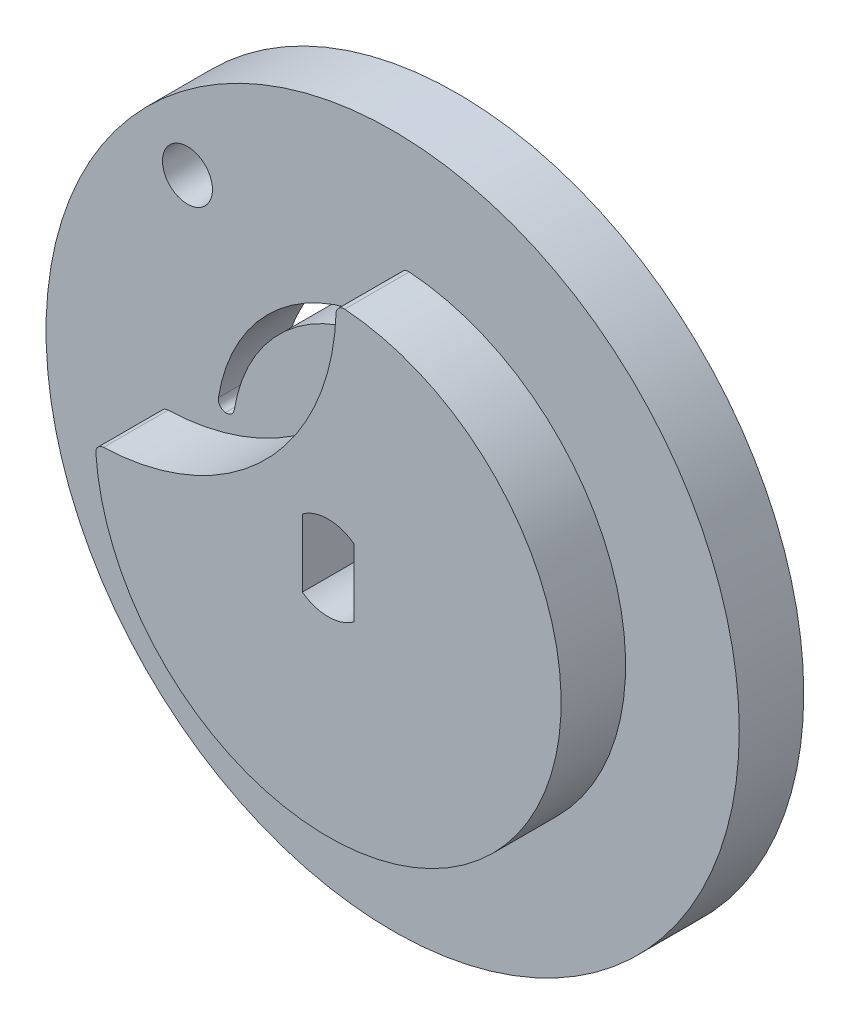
ISO-10303-21;
HEADER;
FILE_DESCRIPTION(('STEP AP214'),'2;1');
FILE_NAME('part.step','',(''),(''),'','','');
FILE_SCHEMA(('AUTOMOTIVE_DESIGN { 1 0 10303 214 1 1 1 1 }'));
ENDSEC;
DATA;
#1=APPLICATION_CONTEXT('core data for automotive mechanical design processes');
#2=APPLICATION_PROTOCOL_DEFINITION('international standard','automotive_design',2000,#1);
#3=PRODUCT_CONTEXT('',#1,'mechanical');
#4=PRODUCT('Part','Part','',(#3));
#5=PRODUCT_RELATED_PRODUCT_CATEGORY('part','',(#4));
#6=PRODUCT_DEFINITION_FORMATION('','',#4);
#7=PRODUCT_DEFINITION_CONTEXT('part definition',#1,'design');
#8=PRODUCT_DEFINITION('design','',#6,#7);
#9=PRODUCT_DEFINITION_SHAPE('','',#8);
#10=(LENGTH_UNIT() NAMED_UNIT(*) SI_UNIT(.MILLI.,.METRE.));
#11=(NAMED_UNIT(*) PLANE_ANGLE_UNIT() SI_UNIT($,.RADIAN.));
#12=(NAMED_UNIT(*) SI_UNIT($,.STERADIAN.) SOLID_ANGLE_UNIT());
#13=UNCERTAINTY_MEASURE_WITH_UNIT(LENGTH_MEASURE(1.E-05),#10,'distance_accuracy_value','');
#14=(GEOMETRIC_REPRESENTATION_CONTEXT(3) GLOBAL_UNCERTAINTY_ASSIGNED_CONTEXT((#13)) GLOBAL_UNIT_ASSIGNED_CONTEXT((#10,
#11,#12)) REPRESENTATION_CONTEXT('',''));
#15=CARTESIAN_POINT('',(0.,0.,0.));
#16=DIRECTION('',(0.,0.,1.));
#17=DIRECTION('',(1.,0.,0.));
#18=AXIS2_PLACEMENT_3D('',#15,#16,#17);
#19=CARTESIAN_POINT('',(0.,0.,4.));
#20=DIRECTION('',(0.,0.,1.));
#21=DIRECTION('',(1.,0.,0.));
#22=AXIS2_PLACEMENT_3D('',#19,#20,#21);
#23=PLANE('',#22);
#24=CARTESIAN_POINT('',(-10.3172463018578,1.66040017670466,4.));
#25=DIRECTION('',(0.,0.,1.));
#26=DIRECTION('',(1.,0.,0.));
#27=AXIS2_PLACEMENT_3D('',#24,#25,#26);
#28=CIRCLE('',#27,0.5);
#29=CARTESIAN_POINT('',(-9.82359815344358,1.58095519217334,4.));
#30=VERTEX_POINT('',#29);
#31=CARTESIAN_POINT('',(-10.372980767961,1.16351621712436,4.));
#32=VERTEX_POINT('',#31);
#33=EDGE_CURVE('E306',#30,#32,#28,.F.);
#34=ORIENTED_EDGE('',*,*,#33,.T.);
#35=CARTESIAN_POINT('',(-10.3172463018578,1.66040017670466,4.));
#36=DIRECTION('',(0.,0.,1.));
#37=DIRECTION('',(1.,0.,0.));
#38=AXIS2_PLACEMENT_3D('',#35,#36,#37);
#39=CIRCLE('',#38,0.5);
#40=CARTESIAN_POINT('',(-10.8108944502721,1.73984516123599,4.));
#41=VERTEX_POINT('',#40);
#42=EDGE_CURVE('E310',#32,#41,#39,.F.);
#43=ORIENTED_EDGE('',*,*,#42,.T.);
#44=CARTESIAN_POINT('',(0.,0.,4.));
#45=DIRECTION('',(0.,0.,1.));
#46=DIRECTION('',(-1.,0.,0.));
#47=AXIS2_PLACEMENT_3D('',#44,#45,#46);
#48=CIRCLE('',#47,10.95);
#49=CARTESIAN_POINT('',(-1.73984516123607,10.8108944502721,4.));
#50=VERTEX_POINT('',#49);
#51=EDGE_CURVE('E231',#50,#41,#48,.T.);
#52=ORIENTED_EDGE('',*,*,#51,.F.);
#53=CARTESIAN_POINT('',(-1.66040017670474,10.3172463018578,4.));
#54=DIRECTION('',(0.,0.,1.));
#55=DIRECTION('',(1.,0.,0.));
#56=AXIS2_PLACEMENT_3D('',#53,#54,#55);
#57=CIRCLE('',#56,0.5);
#58=CARTESIAN_POINT('',(-1.16351621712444,10.372980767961,4.));
#59=VERTEX_POINT('',#58);
#60=EDGE_CURVE('E11',#50,#59,#57,.F.);
#61=ORIENTED_EDGE('',*,*,#60,.T.);
#62=CARTESIAN_POINT('',(-1.66040017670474,10.3172463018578,4.));
#63=DIRECTION('',(0.,0.,1.));
#64=DIRECTION('',(1.,0.,0.));
#65=AXIS2_PLACEMENT_3D('',#62,#63,#64);
#66=CIRCLE('',#65,0.5);
#67=CARTESIAN_POINT('',(-1.58095519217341,9.82359815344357,4.));
#68=VERTEX_POINT('',#67);
#69=EDGE_CURVE('E313',#59,#68,#66,.F.);
#70=ORIENTED_EDGE('',*,*,#69,.T.);
#71=CARTESIAN_POINT('',(0.,0.,4.));
#72=DIRECTION('',(0.,0.,-1.));
#73=DIRECTION('',(-1.,0.,0.));
#74=AXIS2_PLACEMENT_3D('',#71,#72,#73);
#75=CIRCLE('',#74,9.95);
#76=EDGE_CURVE('E234',#30,#68,#75,.T.);
#77=ORIENTED_EDGE('',*,*,#76,.F.);
#78=EDGE_LOOP('',(#34,#43,#52,#61,#70,#77));
#79=FACE_BOUND('',#78,.T.);
#80=CARTESIAN_POINT('',(-12.7279220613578,12.7279220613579,4.));
#81=DIRECTION('',(0.,0.,1.));
#82=DIRECTION('',(1.,0.,0.));
#83=AXIS2_PLACEMENT_3D('',#80,#81,#82);
#84=CIRCLE('',#83,1.55);
#85=CARTESIAN_POINT('',(-11.1779220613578,12.7279220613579,4.));
#86=VERTEX_POINT('',#85);
#87=EDGE_CURVE('E242',#86,#86,#84,.T.);
#88=ORIENTED_EDGE('',*,*,#87,.F.);
#89=EDGE_LOOP('',(#88));
#90=FACE_BOUND('',#89,.T.);
#91=CARTESIAN_POINT('',(0.,0.,4.));
#92=DIRECTION('',(0.,0.,1.));
#93=DIRECTION('',(1.,0.,0.));
#94=AXIS2_PLACEMENT_3D('',#91,#92,#93);
#95=CIRCLE('',#94,21.5);
#96=CARTESIAN_POINT('',(21.5,0.,4.));
#97=VERTEX_POINT('',#96);
#98=EDGE_CURVE('E271',#97,#97,#95,.T.);
#99=ORIENTED_EDGE('',*,*,#98,.T.);
#100=EDGE_LOOP('',(#99));
#101=FACE_BOUND('',#100,.T.);
#102=CARTESIAN_POINT('',(0.,0.,4.));
#103=DIRECTION('',(0.,0.,1.));
#104=DIRECTION('',(1.,0.,0.));
#105=AXIS2_PLACEMENT_3D('',#102,#103,#104);
#106=CIRCLE('',#105,14.45);
#107=CARTESIAN_POINT('',(-14.4135176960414,-1.02616159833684,4.));
#108=VERTEX_POINT('',#107);
#109=CARTESIAN_POINT('',(1.02616159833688,14.4135176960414,4.));
#110=VERTEX_POINT('',#109);
#111=EDGE_CURVE('E223',#108,#110,#106,.T.);
#112=ORIENTED_EDGE('',*,*,#111,.F.);
#113=CARTESIAN_POINT('',(-13.9147800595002,-0.990654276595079,4.));
#114=DIRECTION('',(0.,0.,1.));
#115=DIRECTION('',(1.,0.,0.));
#116=AXIS2_PLACEMENT_3D('',#113,#114,#115);
#117=CIRCLE('',#116,0.5);
#118=CARTESIAN_POINT('',(-13.9321011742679,-0.490954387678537,4.));
#119=VERTEX_POINT('',#118);
#120=EDGE_CURVE('E300',#108,#119,#117,.F.);
#121=ORIENTED_EDGE('',*,*,#120,.T.);
#122=CARTESIAN_POINT('',(-14.45,14.45,4.));
#123=DIRECTION('',(0.,0.,-1.));
#124=DIRECTION('',(1.,0.,0.));
#125=AXIS2_PLACEMENT_3D('',#122,#123,#124);
#126=CIRCLE('',#125,14.9499276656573);
#127=CARTESIAN_POINT('',(0.490954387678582,13.9321011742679,4.));
#128=VERTEX_POINT('',#127);
#129=EDGE_CURVE('E218',#128,#119,#126,.T.);
#130=ORIENTED_EDGE('',*,*,#129,.F.);
#131=CARTESIAN_POINT('',(0.990654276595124,13.9147800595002,4.));
#132=DIRECTION('',(0.,0.,1.));
#133=DIRECTION('',(1.,0.,0.));
#134=AXIS2_PLACEMENT_3D('',#131,#132,#133);
#135=CIRCLE('',#134,0.5);
#136=EDGE_CURVE('E302',#128,#110,#135,.F.);
#137=ORIENTED_EDGE('',*,*,#136,.T.);
#138=EDGE_LOOP('',(#112,#121,#130,#137));
#139=FACE_BOUND('',#138,.T.);
#140=ADVANCED_FACE('F45',(#79,#90,#101,#139),#23,.T.);
#141=CARTESIAN_POINT('',(0.,0.,0.));
#142=DIRECTION('',(0.,0.,1.));
#143=DIRECTION('',(1.,0.,0.));
#144=AXIS2_PLACEMENT_3D('',#141,#142,#143);
#145=PLANE('',#144);
#146=CARTESIAN_POINT('',(-12.7279220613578,12.7279220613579,0.));
#147=DIRECTION('',(0.,0.,1.));
#148=DIRECTION('',(1.,0.,0.));
#149=AXIS2_PLACEMENT_3D('',#146,#147,#148);
#150=CIRCLE('',#149,1.55);
#151=CARTESIAN_POINT('',(-11.1779220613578,12.7279220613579,0.));
#152=VERTEX_POINT('',#151);
#153=EDGE_CURVE('E238',#152,#152,#150,.T.);
#154=ORIENTED_EDGE('',*,*,#153,.T.);
#155=EDGE_LOOP('',(#154));
#156=FACE_BOUND('',#155,.T.);
#157=DIRECTION('',(0.,1.,0.));
#158=VECTOR('',#157,1.);
#159=CARTESIAN_POINT('',(1.6,-2.1,0.));
#160=LINE('',#159,#158);
#161=CARTESIAN_POINT('',(1.6,-2.1,0.));
#162=VERTEX_POINT('',#161);
#163=CARTESIAN_POINT('',(1.6,-2.08119661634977,0.));
#164=VERTEX_POINT('',#163);
#165=EDGE_CURVE('E257',#162,#164,#160,.T.);
#166=ORIENTED_EDGE('',*,*,#165,.T.);
#167=CARTESIAN_POINT('',(0.,0.,0.));
#168=DIRECTION('',(0.,0.,-1.));
#169=DIRECTION('',(-1.,0.,0.));
#170=AXIS2_PLACEMENT_3D('',#167,#168,#169);
#171=CIRCLE('',#170,2.62514368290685);
#172=CARTESIAN_POINT('',(1.6,2.08119661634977,0.));
#173=VERTEX_POINT('',#172);
#174=EDGE_CURVE('E178',#173,#164,#171,.T.);
#175=ORIENTED_EDGE('',*,*,#174,.F.);
#176=CARTESIAN_POINT('',(1.6,2.1,0.));
#177=VERTEX_POINT('',#176);
#178=EDGE_CURVE('E189',#173,#177,#160,.T.);
#179=ORIENTED_EDGE('',*,*,#178,.T.);
#180=CARTESIAN_POINT('',(0.,-0.0748563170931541,0.));
#181=DIRECTION('',(0.,0.,1.));
#182=DIRECTION('',(-1.,0.,0.));
#183=AXIS2_PLACEMENT_3D('',#180,#181,#182);
#184=CIRCLE('',#183,2.7);
#185=CARTESIAN_POINT('',(-1.6,2.1,0.));
#186=VERTEX_POINT('',#185);
#187=EDGE_CURVE('E245',#177,#186,#184,.T.);
#188=ORIENTED_EDGE('',*,*,#187,.T.);
#189=DIRECTION('',(0.,-1.,0.));
#190=VECTOR('',#189,1.);
#191=CARTESIAN_POINT('',(-1.6,-2.1,0.));
#192=LINE('',#191,#190);
#193=CARTESIAN_POINT('',(-1.6,2.08119661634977,0.));
#194=VERTEX_POINT('',#193);
#195=EDGE_CURVE('E251',#186,#194,#192,.T.);
#196=ORIENTED_EDGE('',*,*,#195,.T.);
#197=CARTESIAN_POINT('',(0.,0.,0.));
#198=DIRECTION('',(0.,0.,-1.));
#199=DIRECTION('',(-1.,0.,0.));
#200=AXIS2_PLACEMENT_3D('',#197,#198,#199);
#201=CIRCLE('',#200,2.62514368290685);
#202=CARTESIAN_POINT('',(-1.6,-2.08119661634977,0.));
#203=VERTEX_POINT('',#202);
#204=EDGE_CURVE('E198',#203,#194,#201,.T.);
#205=ORIENTED_EDGE('',*,*,#204,.F.);
#206=CARTESIAN_POINT('',(-1.6,-2.1,0.));
#207=VERTEX_POINT('',#206);
#208=EDGE_CURVE('E250',#203,#207,#192,.T.);
#209=ORIENTED_EDGE('',*,*,#208,.T.);
#210=CARTESIAN_POINT('',(0.,0.0748563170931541,0.));
#211=DIRECTION('',(0.,0.,1.));
#212=DIRECTION('',(1.,0.,0.));
#213=AXIS2_PLACEMENT_3D('',#210,#211,#212);
#214=CIRCLE('',#213,2.7);
#215=EDGE_CURVE('E254',#207,#162,#214,.T.);
#216=ORIENTED_EDGE('',*,*,#215,.T.);
#217=EDGE_LOOP('',(#166,#175,#179,#188,#196,#205,#209,#216));
#218=FACE_BOUND('',#217,.T.);
#219=CARTESIAN_POINT('',(0.,0.,0.));
#220=DIRECTION('',(0.,0.,1.));
#221=DIRECTION('',(1.,0.,0.));
#222=AXIS2_PLACEMENT_3D('',#219,#220,#221);
#223=CIRCLE('',#222,21.5);
#224=CARTESIAN_POINT('',(21.5,0.,0.));
#225=VERTEX_POINT('',#224);
#226=EDGE_CURVE('E270',#225,#225,#223,.T.);
#227=ORIENTED_EDGE('',*,*,#226,.F.);
#228=EDGE_LOOP('',(#227));
#229=FACE_BOUND('',#228,.T.);
#230=CARTESIAN_POINT('',(-1.66040017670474,10.3172463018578,0.));
#231=DIRECTION('',(0.,0.,1.));
#232=DIRECTION('',(1.,0.,0.));
#233=AXIS2_PLACEMENT_3D('',#230,#231,#232);
#234=CIRCLE('',#233,0.5);
#235=CARTESIAN_POINT('',(-1.58095519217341,9.82359815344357,0.));
#236=VERTEX_POINT('',#235);
#237=CARTESIAN_POINT('',(-1.16351621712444,10.372980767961,0.));
#238=VERTEX_POINT('',#237);
#239=EDGE_CURVE('E68',#236,#238,#234,.T.);
#240=ORIENTED_EDGE('',*,*,#239,.T.);
#241=CARTESIAN_POINT('',(-1.66040017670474,10.3172463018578,0.));
#242=DIRECTION('',(0.,0.,1.));
#243=DIRECTION('',(1.,0.,0.));
#244=AXIS2_PLACEMENT_3D('',#241,#242,#243);
#245=CIRCLE('',#244,0.5);
#246=CARTESIAN_POINT('',(-1.73984516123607,10.8108944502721,0.));
#247=VERTEX_POINT('',#246);
#248=EDGE_CURVE('E54',#238,#247,#245,.T.);
#249=ORIENTED_EDGE('',*,*,#248,.T.);
#250=CARTESIAN_POINT('',(0.,0.,0.));
#251=DIRECTION('',(0.,0.,1.));
#252=DIRECTION('',(-1.,0.,0.));
#253=AXIS2_PLACEMENT_3D('',#250,#251,#252);
#254=CIRCLE('',#253,10.95);
#255=CARTESIAN_POINT('',(-10.8108944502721,1.73984516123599,0.));
#256=VERTEX_POINT('',#255);
#257=EDGE_CURVE('E226',#247,#256,#254,.T.);
#258=ORIENTED_EDGE('',*,*,#257,.T.);
#259=CARTESIAN_POINT('',(-10.3172463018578,1.66040017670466,0.));
#260=DIRECTION('',(0.,0.,1.));
#261=DIRECTION('',(1.,0.,0.));
#262=AXIS2_PLACEMENT_3D('',#259,#260,#261);
#263=CIRCLE('',#262,0.5);
#264=CARTESIAN_POINT('',(-10.372980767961,1.16351621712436,0.));
#265=VERTEX_POINT('',#264);
#266=EDGE_CURVE('E308',#256,#265,#263,.T.);
#267=ORIENTED_EDGE('',*,*,#266,.T.);
#268=CARTESIAN_POINT('',(-10.3172463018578,1.66040017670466,0.));
#269=DIRECTION('',(0.,0.,1.));
#270=DIRECTION('',(1.,0.,0.));
#271=AXIS2_PLACEMENT_3D('',#268,#269,#270);
#272=CIRCLE('',#271,0.5);
#273=CARTESIAN_POINT('',(-9.82359815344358,1.58095519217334,0.));
#274=VERTEX_POINT('',#273);
#275=EDGE_CURVE('E304',#265,#274,#272,.T.);
#276=ORIENTED_EDGE('',*,*,#275,.T.);
#277=CARTESIAN_POINT('',(0.,0.,0.));
#278=DIRECTION('',(0.,0.,-1.));
#279=DIRECTION('',(-1.,0.,0.));
#280=AXIS2_PLACEMENT_3D('',#277,#278,#279);
#281=CIRCLE('',#280,9.95);
#282=EDGE_CURVE('E235',#274,#236,#281,.T.);
#283=ORIENTED_EDGE('',*,*,#282,.T.);
#284=EDGE_LOOP('',(#240,#249,#258,#267,#276,#283));
#285=FACE_BOUND('',#284,.T.);
#286=ADVANCED_FACE('F327',(#156,#218,#229,#285),#145,.F.);
#287=CARTESIAN_POINT('',(0.,0.,4.));
#288=DIRECTION('',(0.,0.,-1.));
#289=DIRECTION('',(-1.,0.,0.));
#290=AXIS2_PLACEMENT_3D('',#287,#288,#289);
#291=CYLINDRICAL_SURFACE('',#290,21.5);
#292=ORIENTED_EDGE('',*,*,#98,.F.);
#293=EDGE_LOOP('',(#292));
#294=FACE_BOUND('',#293,.T.);
#295=ORIENTED_EDGE('',*,*,#226,.T.);
#296=EDGE_LOOP('',(#295));
#297=FACE_BOUND('',#296,.T.);
#298=ADVANCED_FACE('F382',(#294,#297),#291,.T.);
#299=CARTESIAN_POINT('',(0.,-0.0748563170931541,4.));
#300=DIRECTION('',(0.,0.,-1.));
#301=DIRECTION('',(-1.,0.,0.));
#302=AXIS2_PLACEMENT_3D('',#299,#300,#301);
#303=CYLINDRICAL_SURFACE('',#302,2.7);
#304=ORIENTED_EDGE('',*,*,#187,.F.);
#305=DIRECTION('',(0.,0.,-1.));
#306=VECTOR('',#305,1.);
#307=CARTESIAN_POINT('',(1.6,2.1,4.));
#308=LINE('',#307,#306);
#309=CARTESIAN_POINT('',(1.6,2.1,8.));
#310=VERTEX_POINT('',#309);
#311=EDGE_CURVE('E260',#310,#177,#308,.T.);
#312=ORIENTED_EDGE('',*,*,#311,.F.);
#313=CARTESIAN_POINT('',(0.,-0.0748563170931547,8.));
#314=DIRECTION('',(0.,0.,1.));
#315=DIRECTION('',(-1.,0.,0.));
#316=AXIS2_PLACEMENT_3D('',#313,#314,#315);
#317=CIRCLE('',#316,2.7);
#318=CARTESIAN_POINT('',(-1.6,2.1,8.));
#319=VERTEX_POINT('',#318);
#320=EDGE_CURVE('E191',#310,#319,#317,.T.);
#321=ORIENTED_EDGE('',*,*,#320,.T.);
#322=DIRECTION('',(0.,0.,-1.));
#323=VECTOR('',#322,1.);
#324=CARTESIAN_POINT('',(-1.6,2.1,4.));
#325=LINE('',#324,#323);
#326=EDGE_CURVE('E267',#319,#186,#325,.T.);
#327=ORIENTED_EDGE('',*,*,#326,.T.);
#328=EDGE_LOOP('',(#304,#312,#321,#327));
#329=FACE_BOUND('',#328,.T.);
#330=ADVANCED_FACE('F505',(#329),#303,.F.);
#331=CARTESIAN_POINT('',(-1.6,-2.1,4.));
#332=DIRECTION('',(1.,0.,0.));
#333=DIRECTION('',(0.,0.,-1.));
#334=AXIS2_PLACEMENT_3D('',#331,#332,#333);
#335=PLANE('',#334);
#336=DIRECTION('',(0.,0.,-1.));
#337=VECTOR('',#336,1.);
#338=CARTESIAN_POINT('',(-1.6,-2.08119661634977,1.2));
#339=LINE('',#338,#337);
#340=CARTESIAN_POINT('',(-1.6,-2.08119661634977,1.2));
#341=VERTEX_POINT('',#340);
#342=EDGE_CURVE('E200',#341,#203,#339,.T.);
#343=ORIENTED_EDGE('',*,*,#342,.F.);
#344=DIRECTION('',(0.,-1.,0.));
#345=VECTOR('',#344,1.);
#346=CARTESIAN_POINT('',(-1.6,0.,1.2));
#347=LINE('',#346,#345);
#348=CARTESIAN_POINT('',(-1.6,2.08119661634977,1.2));
#349=VERTEX_POINT('',#348);
#350=EDGE_CURVE('E195',#349,#341,#347,.T.);
#351=ORIENTED_EDGE('',*,*,#350,.F.);
#352=DIRECTION('',(0.,0.,-1.));
#353=VECTOR('',#352,1.);
#354=CARTESIAN_POINT('',(-1.6,2.08119661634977,1.2));
#355=LINE('',#354,#353);
#356=EDGE_CURVE('E203',#349,#194,#355,.T.);
#357=ORIENTED_EDGE('',*,*,#356,.T.);
#358=ORIENTED_EDGE('',*,*,#195,.F.);
#359=ORIENTED_EDGE('',*,*,#326,.F.);
#360=DIRECTION('',(0.,-1.,0.));
#361=VECTOR('',#360,1.);
#362=CARTESIAN_POINT('',(-1.6,-2.1,8.));
#363=LINE('',#362,#361);
#364=CARTESIAN_POINT('',(-1.6,-2.1,8.));
#365=VERTEX_POINT('',#364);
#366=EDGE_CURVE('E209',#319,#365,#363,.T.);
#367=ORIENTED_EDGE('',*,*,#366,.T.);
#368=DIRECTION('',(0.,0.,-1.));
#369=VECTOR('',#368,1.);
#370=CARTESIAN_POINT('',(-1.6,-2.1,4.));
#371=LINE('',#370,#369);
#372=EDGE_CURVE('E264',#365,#207,#371,.T.);
#373=ORIENTED_EDGE('',*,*,#372,.T.);
#374=ORIENTED_EDGE('',*,*,#208,.F.);
#375=EDGE_LOOP('',(#343,#351,#357,#358,#359,#367,#373,#374));
#376=FACE_BOUND('',#375,.T.);
#377=ADVANCED_FACE('F493',(#376),#335,.T.);
#378=CARTESIAN_POINT('',(0.,0.0748563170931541,4.));
#379=DIRECTION('',(0.,0.,-1.));
#380=DIRECTION('',(-1.,0.,0.));
#381=AXIS2_PLACEMENT_3D('',#378,#379,#380);
#382=CYLINDRICAL_SURFACE('',#381,2.7);
#383=ORIENTED_EDGE('',*,*,#215,.F.);
#384=ORIENTED_EDGE('',*,*,#372,.F.);
#385=CARTESIAN_POINT('',(0.,0.0748563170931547,8.));
#386=DIRECTION('',(0.,0.,1.));
#387=DIRECTION('',(1.,0.,0.));
#388=AXIS2_PLACEMENT_3D('',#385,#386,#387);
#389=CIRCLE('',#388,2.7);
#390=CARTESIAN_POINT('',(1.6,-2.1,8.));
#391=VERTEX_POINT('',#390);
#392=EDGE_CURVE('E212',#365,#391,#389,.T.);
#393=ORIENTED_EDGE('',*,*,#392,.T.);
#394=DIRECTION('',(0.,0.,-1.));
#395=VECTOR('',#394,1.);
#396=CARTESIAN_POINT('',(1.6,-2.1,4.));
#397=LINE('',#396,#395);
#398=EDGE_CURVE('E262',#391,#162,#397,.T.);
#399=ORIENTED_EDGE('',*,*,#398,.T.);
#400=EDGE_LOOP('',(#383,#384,#393,#399));
#401=FACE_BOUND('',#400,.T.);
#402=ADVANCED_FACE('F480',(#401),#382,.F.);
#403=CARTESIAN_POINT('',(1.6,-2.1,4.));
#404=DIRECTION('',(-1.,0.,0.));
#405=DIRECTION('',(0.,0.,1.));
#406=AXIS2_PLACEMENT_3D('',#403,#404,#405);
#407=PLANE('',#406);
#408=DIRECTION('',(0.,0.,-1.));
#409=VECTOR('',#408,1.);
#410=CARTESIAN_POINT('',(1.6,2.08119661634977,1.2));
#411=LINE('',#410,#409);
#412=CARTESIAN_POINT('',(1.6,2.08119661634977,1.2));
#413=VERTEX_POINT('',#412);
#414=EDGE_CURVE('E182',#413,#173,#411,.T.);
#415=ORIENTED_EDGE('',*,*,#414,.F.);
#416=DIRECTION('',(0.,1.,0.));
#417=VECTOR('',#416,1.);
#418=CARTESIAN_POINT('',(1.6,0.,1.2));
#419=LINE('',#418,#417);
#420=CARTESIAN_POINT('',(1.6,-2.08119661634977,1.2));
#421=VERTEX_POINT('',#420);
#422=EDGE_CURVE('E170',#421,#413,#419,.T.);
#423=ORIENTED_EDGE('',*,*,#422,.F.);
#424=DIRECTION('',(0.,0.,-1.));
#425=VECTOR('',#424,1.);
#426=CARTESIAN_POINT('',(1.6,-2.08119661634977,1.2));
#427=LINE('',#426,#425);
#428=EDGE_CURVE('E184',#421,#164,#427,.T.);
#429=ORIENTED_EDGE('',*,*,#428,.T.);
#430=ORIENTED_EDGE('',*,*,#165,.F.);
#431=ORIENTED_EDGE('',*,*,#398,.F.);
#432=DIRECTION('',(0.,1.,0.));
#433=VECTOR('',#432,1.);
#434=CARTESIAN_POINT('',(1.6,-2.1,8.));
#435=LINE('',#434,#433);
#436=EDGE_CURVE('E215',#391,#310,#435,.T.);
#437=ORIENTED_EDGE('',*,*,#436,.T.);
#438=ORIENTED_EDGE('',*,*,#311,.T.);
#439=ORIENTED_EDGE('',*,*,#178,.F.);
#440=EDGE_LOOP('',(#415,#423,#429,#430,#431,#437,#438,#439));
#441=FACE_BOUND('',#440,.T.);
#442=ADVANCED_FACE('F187',(#441),#407,.T.);
#443=CARTESIAN_POINT('',(-12.7279220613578,12.7279220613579,4.));
#444=DIRECTION('',(0.,0.,-1.));
#445=DIRECTION('',(-1.,0.,0.));
#446=AXIS2_PLACEMENT_3D('',#443,#444,#445);
#447=CYLINDRICAL_SURFACE('',#446,1.55);
#448=ORIENTED_EDGE('',*,*,#87,.T.);
#449=EDGE_LOOP('',(#448));
#450=FACE_BOUND('',#449,.T.);
#451=ORIENTED_EDGE('',*,*,#153,.F.);
#452=EDGE_LOOP('',(#451));
#453=FACE_BOUND('',#452,.T.);
#454=ADVANCED_FACE('F479',(#450,#453),#447,.F.);
#455=CARTESIAN_POINT('',(0.,0.,4.));
#456=DIRECTION('',(0.,0.,-1.));
#457=DIRECTION('',(-1.,0.,0.));
#458=AXIS2_PLACEMENT_3D('',#455,#456,#457);
#459=CYLINDRICAL_SURFACE('',#458,10.95);
#460=ORIENTED_EDGE('',*,*,#51,.T.);
#461=DIRECTION('',(0.,0.,-1.));
#462=VECTOR('',#461,1.);
#463=CARTESIAN_POINT('',(-10.8108944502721,1.73984516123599,4.));
#464=LINE('',#463,#462);
#465=EDGE_CURVE('E298',#41,#256,#464,.T.);
#466=ORIENTED_EDGE('',*,*,#465,.T.);
#467=ORIENTED_EDGE('',*,*,#257,.F.);
#468=DIRECTION('',(0.,0.,-1.));
#469=VECTOR('',#468,1.);
#470=CARTESIAN_POINT('',(-1.73984516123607,10.8108944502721,4.));
#471=LINE('',#470,#469);
#472=EDGE_CURVE('E296',#247,#50,#471,.F.);
#473=ORIENTED_EDGE('',*,*,#472,.T.);
#474=EDGE_LOOP('',(#460,#466,#467,#473));
#475=FACE_BOUND('',#474,.T.);
#476=ADVANCED_FACE('F330',(#475),#459,.F.);
#477=CARTESIAN_POINT('',(0.,0.,4.));
#478=DIRECTION('',(0.,0.,-1.));
#479=DIRECTION('',(-1.,0.,0.));
#480=AXIS2_PLACEMENT_3D('',#477,#478,#479);
#481=CYLINDRICAL_SURFACE('',#480,9.95);
#482=ORIENTED_EDGE('',*,*,#282,.F.);
#483=DIRECTION('',(0.,0.,-1.));
#484=VECTOR('',#483,1.);
#485=CARTESIAN_POINT('',(-9.82359815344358,1.58095519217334,4.));
#486=LINE('',#485,#484);
#487=EDGE_CURVE('E293',#274,#30,#486,.F.);
#488=ORIENTED_EDGE('',*,*,#487,.T.);
#489=ORIENTED_EDGE('',*,*,#76,.T.);
#490=DIRECTION('',(0.,0.,-1.));
#491=VECTOR('',#490,1.);
#492=CARTESIAN_POINT('',(-1.58095519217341,9.82359815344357,4.));
#493=LINE('',#492,#491);
#494=EDGE_CURVE('E290',#68,#236,#493,.T.);
#495=ORIENTED_EDGE('',*,*,#494,.T.);
#496=EDGE_LOOP('',(#482,#488,#489,#495));
#497=FACE_BOUND('',#496,.T.);
#498=ADVANCED_FACE('F338',(#497),#481,.T.);
#499=CARTESIAN_POINT('',(-7.225,7.22500000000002,8.));
#500=DIRECTION('',(0.,0.,1.));
#501=DIRECTION('',(1.,0.,0.));
#502=AXIS2_PLACEMENT_3D('',#499,#500,#501);
#503=PLANE('',#502);
#504=CARTESIAN_POINT('',(-14.45,14.45,8.));
#505=DIRECTION('',(0.,0.,-1.));
#506=DIRECTION('',(1.,0.,0.));
#507=AXIS2_PLACEMENT_3D('',#504,#505,#506);
#508=CIRCLE('',#507,14.9499276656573);
#509=CARTESIAN_POINT('',(0.490954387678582,13.9321011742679,8.));
#510=VERTEX_POINT('',#509);
#511=CARTESIAN_POINT('',(-13.9321011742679,-0.490954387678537,8.));
#512=VERTEX_POINT('',#511);
#513=EDGE_CURVE('E219',#510,#512,#508,.T.);
#514=ORIENTED_EDGE('',*,*,#513,.T.);
#515=CARTESIAN_POINT('',(-13.9147800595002,-0.990654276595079,8.));
#516=DIRECTION('',(0.,0.,1.));
#517=DIRECTION('',(1.,0.,0.));
#518=AXIS2_PLACEMENT_3D('',#515,#516,#517);
#519=CIRCLE('',#518,0.5);
#520=CARTESIAN_POINT('',(-14.4135176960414,-1.02616159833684,8.));
#521=VERTEX_POINT('',#520);
#522=EDGE_CURVE('E288',#512,#521,#519,.T.);
#523=ORIENTED_EDGE('',*,*,#522,.T.);
#524=CARTESIAN_POINT('',(0.,0.,8.));
#525=DIRECTION('',(0.,0.,1.));
#526=DIRECTION('',(1.,0.,0.));
#527=AXIS2_PLACEMENT_3D('',#524,#525,#526);
#528=CIRCLE('',#527,14.45);
#529=CARTESIAN_POINT('',(1.02616159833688,14.4135176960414,8.));
#530=VERTEX_POINT('',#529);
#531=EDGE_CURVE('E222',#521,#530,#528,.T.);
#532=ORIENTED_EDGE('',*,*,#531,.T.);
#533=CARTESIAN_POINT('',(0.990654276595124,13.9147800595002,8.));
#534=DIRECTION('',(0.,0.,1.));
#535=DIRECTION('',(1.,0.,0.));
#536=AXIS2_PLACEMENT_3D('',#533,#534,#535);
#537=CIRCLE('',#536,0.5);
#538=EDGE_CURVE('E286',#530,#510,#537,.T.);
#539=ORIENTED_EDGE('',*,*,#538,.T.);
#540=EDGE_LOOP('',(#514,#523,#532,#539));
#541=FACE_BOUND('',#540,.T.);
#542=ORIENTED_EDGE('',*,*,#366,.F.);
#543=ORIENTED_EDGE('',*,*,#320,.F.);
#544=ORIENTED_EDGE('',*,*,#436,.F.);
#545=ORIENTED_EDGE('',*,*,#392,.F.);
#546=EDGE_LOOP('',(#542,#543,#544,#545));
#547=FACE_BOUND('',#546,.T.);
#548=ADVANCED_FACE('F361',(#541,#547),#503,.T.);
#549=CARTESIAN_POINT('',(-14.45,14.45,8.));
#550=DIRECTION('',(0.,0.,-1.));
#551=DIRECTION('',(-1.,0.,0.));
#552=AXIS2_PLACEMENT_3D('',#549,#550,#551);
#553=CYLINDRICAL_SURFACE('',#552,14.9499276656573);
#554=ORIENTED_EDGE('',*,*,#129,.T.);
#555=DIRECTION('',(0.,0.,-1.));
#556=VECTOR('',#555,1.);
#557=CARTESIAN_POINT('',(-13.9321011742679,-0.490954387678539,8.));
#558=LINE('',#557,#556);
#559=EDGE_CURVE('E284',#119,#512,#558,.F.);
#560=ORIENTED_EDGE('',*,*,#559,.T.);
#561=ORIENTED_EDGE('',*,*,#513,.F.);
#562=DIRECTION('',(0.,0.,-1.));
#563=VECTOR('',#562,1.);
#564=CARTESIAN_POINT('',(0.490954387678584,13.9321011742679,8.));
#565=LINE('',#564,#563);
#566=EDGE_CURVE('E281',#510,#128,#565,.T.);
#567=ORIENTED_EDGE('',*,*,#566,.T.);
#568=EDGE_LOOP('',(#554,#560,#561,#567));
#569=FACE_BOUND('',#568,.T.);
#570=ADVANCED_FACE('F365',(#569),#553,.F.);
#571=CARTESIAN_POINT('',(0.,0.,8.));
#572=DIRECTION('',(0.,0.,-1.));
#573=DIRECTION('',(-1.,0.,0.));
#574=AXIS2_PLACEMENT_3D('',#571,#572,#573);
#575=CYLINDRICAL_SURFACE('',#574,14.45);
#576=ORIENTED_EDGE('',*,*,#531,.F.);
#577=DIRECTION('',(0.,0.,-1.));
#578=VECTOR('',#577,1.);
#579=CARTESIAN_POINT('',(-14.4135176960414,-1.02616159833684,8.));
#580=LINE('',#579,#578);
#581=EDGE_CURVE('E278',#521,#108,#580,.T.);
#582=ORIENTED_EDGE('',*,*,#581,.T.);
#583=ORIENTED_EDGE('',*,*,#111,.T.);
#584=DIRECTION('',(0.,0.,-1.));
#585=VECTOR('',#584,1.);
#586=CARTESIAN_POINT('',(1.02616159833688,14.4135176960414,8.));
#587=LINE('',#586,#585);
#588=EDGE_CURVE('E274',#110,#530,#587,.F.);
#589=ORIENTED_EDGE('',*,*,#588,.T.);
#590=EDGE_LOOP('',(#576,#582,#583,#589));
#591=FACE_BOUND('',#590,.T.);
#592=ADVANCED_FACE('F353',(#591),#575,.T.);
#593=CARTESIAN_POINT('',(0.,0.,1.2));
#594=DIRECTION('',(0.,0.,-1.));
#595=DIRECTION('',(-1.,0.,0.));
#596=AXIS2_PLACEMENT_3D('',#593,#594,#595);
#597=CYLINDRICAL_SURFACE('',#596,2.62514368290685);
#598=ORIENTED_EDGE('',*,*,#174,.T.);
#599=ORIENTED_EDGE('',*,*,#428,.F.);
#600=CARTESIAN_POINT('',(0.,0.,1.2));
#601=DIRECTION('',(0.,0.,-1.));
#602=DIRECTION('',(-1.,0.,0.));
#603=AXIS2_PLACEMENT_3D('',#600,#601,#602);
#604=CIRCLE('',#603,2.62514368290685);
#605=EDGE_CURVE('E173',#413,#421,#604,.T.);
#606=ORIENTED_EDGE('',*,*,#605,.F.);
#607=ORIENTED_EDGE('',*,*,#414,.T.);
#608=EDGE_LOOP('',(#598,#599,#606,#607));
#609=FACE_BOUND('',#608,.T.);
#610=ADVANCED_FACE('F181',(#609),#597,.F.);
#611=CARTESIAN_POINT('',(0.,0.,1.2));
#612=DIRECTION('',(0.,0.,-1.));
#613=DIRECTION('',(-1.,0.,0.));
#614=AXIS2_PLACEMENT_3D('',#611,#612,#613);
#615=PLANE('',#614);
#616=ORIENTED_EDGE('',*,*,#422,.T.);
#617=ORIENTED_EDGE('',*,*,#605,.T.);
#618=EDGE_LOOP('',(#616,#617));
#619=FACE_BOUND('',#618,.T.);
#620=ADVANCED_FACE('F172',(#619),#615,.T.);
#621=CARTESIAN_POINT('',(0.,0.,1.2));
#622=DIRECTION('',(0.,0.,-1.));
#623=DIRECTION('',(-1.,0.,0.));
#624=AXIS2_PLACEMENT_3D('',#621,#622,#623);
#625=CYLINDRICAL_SURFACE('',#624,2.62514368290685);
#626=ORIENTED_EDGE('',*,*,#204,.T.);
#627=ORIENTED_EDGE('',*,*,#356,.F.);
#628=CARTESIAN_POINT('',(0.,0.,1.2));
#629=DIRECTION('',(0.,0.,-1.));
#630=DIRECTION('',(-1.,0.,0.));
#631=AXIS2_PLACEMENT_3D('',#628,#629,#630);
#632=CIRCLE('',#631,2.62514368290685);
#633=EDGE_CURVE('E197',#341,#349,#632,.T.);
#634=ORIENTED_EDGE('',*,*,#633,.F.);
#635=ORIENTED_EDGE('',*,*,#342,.T.);
#636=EDGE_LOOP('',(#626,#627,#634,#635));
#637=FACE_BOUND('',#636,.T.);
#638=ADVANCED_FACE('F378',(#637),#625,.F.);
#639=CARTESIAN_POINT('',(0.,0.,1.2));
#640=DIRECTION('',(0.,0.,-1.));
#641=DIRECTION('',(-1.,0.,0.));
#642=AXIS2_PLACEMENT_3D('',#639,#640,#641);
#643=PLANE('',#642);
#644=ORIENTED_EDGE('',*,*,#350,.T.);
#645=ORIENTED_EDGE('',*,*,#633,.T.);
#646=EDGE_LOOP('',(#644,#645));
#647=FACE_BOUND('',#646,.T.);
#648=ADVANCED_FACE('F370',(#647),#643,.T.);
#649=CARTESIAN_POINT('',(-13.9147800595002,-0.990654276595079,8.));
#650=DIRECTION('',(0.,0.,1.));
#651=DIRECTION('',(1.,0.,0.));
#652=AXIS2_PLACEMENT_3D('',#649,#650,#651);
#653=CYLINDRICAL_SURFACE('',#652,0.5);
#654=ORIENTED_EDGE('',*,*,#522,.F.);
#655=ORIENTED_EDGE('',*,*,#559,.F.);
#656=ORIENTED_EDGE('',*,*,#120,.F.);
#657=ORIENTED_EDGE('',*,*,#581,.F.);
#658=EDGE_LOOP('',(#654,#655,#656,#657));
#659=FACE_BOUND('',#658,.T.);
#660=ADVANCED_FACE('F368',(#659),#653,.T.);
#661=CARTESIAN_POINT('',(0.990654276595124,13.9147800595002,8.));
#662=DIRECTION('',(0.,0.,1.));
#663=DIRECTION('',(1.,0.,0.));
#664=AXIS2_PLACEMENT_3D('',#661,#662,#663);
#665=CYLINDRICAL_SURFACE('',#664,0.5);
#666=ORIENTED_EDGE('',*,*,#538,.F.);
#667=ORIENTED_EDGE('',*,*,#588,.F.);
#668=ORIENTED_EDGE('',*,*,#136,.F.);
#669=ORIENTED_EDGE('',*,*,#566,.F.);
#670=EDGE_LOOP('',(#666,#667,#668,#669));
#671=FACE_BOUND('',#670,.T.);
#672=ADVANCED_FACE('F357',(#671),#665,.T.);
#673=CARTESIAN_POINT('',(-10.3172463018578,1.66040017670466,4.));
#674=DIRECTION('',(0.,0.,-1.));
#675=DIRECTION('',(-1.,0.,0.));
#676=AXIS2_PLACEMENT_3D('',#673,#674,#675);
#677=CYLINDRICAL_SURFACE('',#676,0.5);
#678=ORIENTED_EDGE('',*,*,#465,.F.);
#679=ORIENTED_EDGE('',*,*,#42,.F.);
#680=DIRECTION('',(0.,0.,1.));
#681=VECTOR('',#680,1.);
#682=CARTESIAN_POINT('',(-10.372980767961,1.16351621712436,4.));
#683=LINE('',#682,#681);
#684=EDGE_CURVE('E202',#265,#32,#683,.T.);
#685=ORIENTED_EDGE('',*,*,#684,.F.);
#686=ORIENTED_EDGE('',*,*,#266,.F.);
#687=EDGE_LOOP('',(#678,#679,#685,#686));
#688=FACE_BOUND('',#687,.T.);
#689=ADVANCED_FACE('F334',(#688),#677,.F.);
#690=CARTESIAN_POINT('',(-10.3172463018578,1.66040017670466,4.));
#691=DIRECTION('',(0.,0.,-1.));
#692=DIRECTION('',(-1.,0.,0.));
#693=AXIS2_PLACEMENT_3D('',#690,#691,#692);
#694=CYLINDRICAL_SURFACE('',#693,0.5);
#695=ORIENTED_EDGE('',*,*,#33,.F.);
#696=ORIENTED_EDGE('',*,*,#487,.F.);
#697=ORIENTED_EDGE('',*,*,#275,.F.);
#698=ORIENTED_EDGE('',*,*,#684,.T.);
#699=EDGE_LOOP('',(#695,#696,#697,#698));
#700=FACE_BOUND('',#699,.T.);
#701=ADVANCED_FACE('F340',(#700),#694,.F.);
#702=CARTESIAN_POINT('',(-1.66040017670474,10.3172463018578,4.));
#703=DIRECTION('',(0.,0.,-1.));
#704=DIRECTION('',(-1.,0.,0.));
#705=AXIS2_PLACEMENT_3D('',#702,#703,#704);
#706=CYLINDRICAL_SURFACE('',#705,0.5);
#707=DIRECTION('',(0.,0.,1.));
#708=VECTOR('',#707,1.);
#709=CARTESIAN_POINT('',(-1.16351621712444,10.372980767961,0.));
#710=LINE('',#709,#708);
#711=EDGE_CURVE('E49',#59,#238,#710,.F.);
#712=ORIENTED_EDGE('',*,*,#711,.F.);
#713=ORIENTED_EDGE('',*,*,#60,.F.);
#714=ORIENTED_EDGE('',*,*,#472,.F.);
#715=ORIENTED_EDGE('',*,*,#248,.F.);
#716=EDGE_LOOP('',(#712,#713,#714,#715));
#717=FACE_BOUND('',#716,.T.);
#718=ADVANCED_FACE('F47',(#717),#706,.F.);
#719=CARTESIAN_POINT('',(-1.66040017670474,10.3172463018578,4.));
#720=DIRECTION('',(0.,0.,-1.));
#721=DIRECTION('',(-1.,0.,0.));
#722=AXIS2_PLACEMENT_3D('',#719,#720,#721);
#723=CYLINDRICAL_SURFACE('',#722,0.5);
#724=ORIENTED_EDGE('',*,*,#69,.F.);
#725=ORIENTED_EDGE('',*,*,#711,.T.);
#726=ORIENTED_EDGE('',*,*,#239,.F.);
#727=ORIENTED_EDGE('',*,*,#494,.F.);
#728=EDGE_LOOP('',(#724,#725,#726,#727));
#729=FACE_BOUND('',#728,.T.);
#730=ADVANCED_FACE('F322',(#729),#723,.F.);
#731=CLOSED_SHELL('',(#140,#286,#298,#330,#377,#402,#442,#454,#476,#498,#548,#570,#592,#610,
#620,#638,#648,#660,#672,#689,#701,#718,#730));
#732=MANIFOLD_SOLID_BREP('B2',#731);
#733=ADVANCED_BREP_SHAPE_REPRESENTATION('',(#18,#732),#14);
#734=SHAPE_DEFINITION_REPRESENTATION(#9,#733);
ENDSEC;
END-ISO-10303-21;
